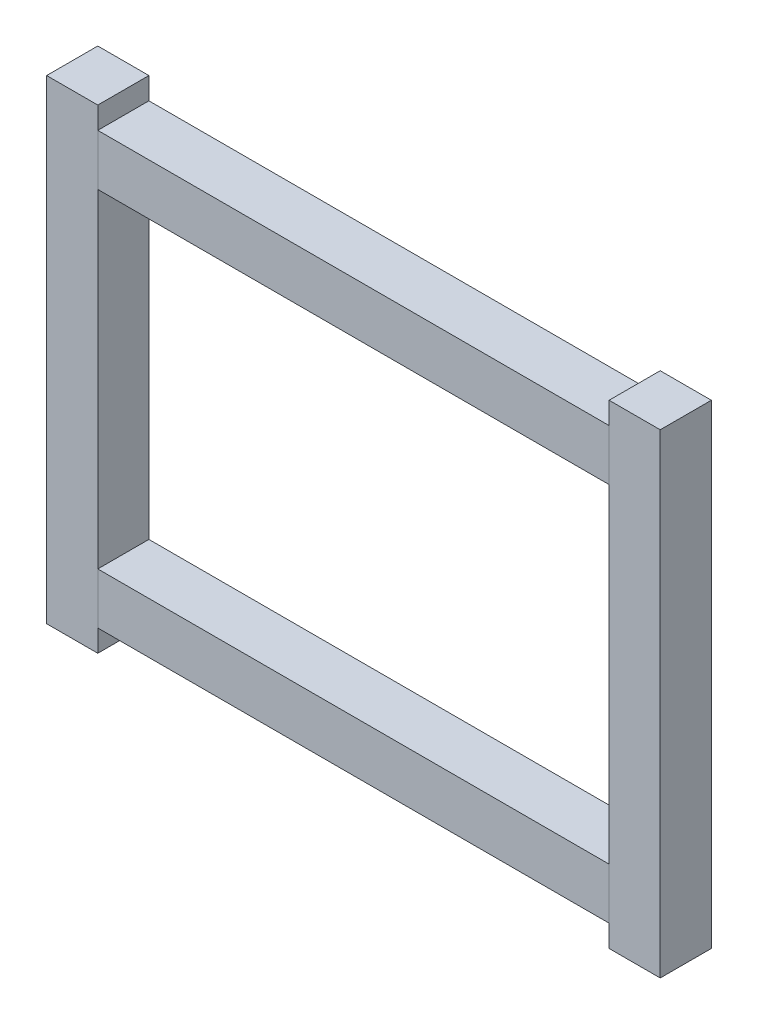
ISO-10303-21;
HEADER;
FILE_DESCRIPTION(('STEP AP214'),'2;1');
FILE_NAME('part.step','',(''),(''),'','','');
FILE_SCHEMA(('AUTOMOTIVE_DESIGN { 1 0 10303 214 1 1 1 1 }'));
ENDSEC;
DATA;
#1=APPLICATION_CONTEXT('core data for automotive mechanical design processes');
#2=APPLICATION_PROTOCOL_DEFINITION('international standard','automotive_design',2000,#1);
#3=PRODUCT_CONTEXT('',#1,'mechanical');
#4=PRODUCT('Part','Part','',(#3));
#5=PRODUCT_RELATED_PRODUCT_CATEGORY('part','',(#4));
#6=PRODUCT_DEFINITION_FORMATION('','',#4);
#7=PRODUCT_DEFINITION_CONTEXT('part definition',#1,'design');
#8=PRODUCT_DEFINITION('design','',#6,#7);
#9=PRODUCT_DEFINITION_SHAPE('','',#8);
#10=(LENGTH_UNIT() NAMED_UNIT(*) SI_UNIT(.MILLI.,.METRE.));
#11=(NAMED_UNIT(*) PLANE_ANGLE_UNIT() SI_UNIT($,.RADIAN.));
#12=(NAMED_UNIT(*) SI_UNIT($,.STERADIAN.) SOLID_ANGLE_UNIT());
#13=UNCERTAINTY_MEASURE_WITH_UNIT(LENGTH_MEASURE(1.E-05),#10,'distance_accuracy_value','');
#14=(GEOMETRIC_REPRESENTATION_CONTEXT(3) GLOBAL_UNCERTAINTY_ASSIGNED_CONTEXT((#13)) GLOBAL_UNIT_ASSIGNED_CONTEXT((#10,
#11,#12)) REPRESENTATION_CONTEXT('',''));
#15=CARTESIAN_POINT('',(0.,0.,0.));
#16=DIRECTION('',(0.,0.,1.));
#17=DIRECTION('',(1.,0.,0.));
#18=AXIS2_PLACEMENT_3D('',#15,#16,#17);
#19=CARTESIAN_POINT('',(140.,143.798989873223,0.));
#20=DIRECTION('',(-1.,0.,0.));
#21=DIRECTION('',(0.,-1.,0.));
#22=AXIS2_PLACEMENT_3D('',#19,#20,#21);
#23=PLANE('',#22);
#24=DIRECTION('',(0.,-1.,0.));
#25=VECTOR('',#24,1.);
#26=CARTESIAN_POINT('',(139.999999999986,103.999999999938,0.));
#27=LINE('',#26,#25);
#28=CARTESIAN_POINT('',(140.0000000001,118.,0.));
#29=VERTEX_POINT('',#28);
#30=CARTESIAN_POINT('',(140.0000000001,104.,0.));
#31=VERTEX_POINT('',#30);
#32=EDGE_CURVE('E110',#29,#31,#27,.T.);
#33=ORIENTED_EDGE('',*,*,#32,.F.);
#34=DIRECTION('',(0.,0.,-1.));
#35=VECTOR('',#34,1.);
#36=CARTESIAN_POINT('',(139.999999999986,118.,14.));
#37=LINE('',#36,#35);
#38=CARTESIAN_POINT('',(140.0000000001,118.,14.));
#39=VERTEX_POINT('',#38);
#40=EDGE_CURVE('E85',#39,#29,#37,.T.);
#41=ORIENTED_EDGE('',*,*,#40,.F.);
#42=DIRECTION('',(0.,1.,0.));
#43=VECTOR('',#42,1.);
#44=CARTESIAN_POINT('',(139.999999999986,103.999999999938,14.));
#45=LINE('',#44,#43);
#46=CARTESIAN_POINT('',(140.0000000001,104.,14.));
#47=VERTEX_POINT('',#46);
#48=EDGE_CURVE('E12',#47,#39,#45,.T.);
#49=ORIENTED_EDGE('',*,*,#48,.F.);
#50=DIRECTION('',(0.,0.,1.));
#51=VECTOR('',#50,1.);
#52=CARTESIAN_POINT('',(139.999999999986,104.,14.));
#53=LINE('',#52,#51);
#54=EDGE_CURVE('E45',#31,#47,#53,.T.);
#55=ORIENTED_EDGE('',*,*,#54,.F.);
#56=EDGE_LOOP('',(#33,#41,#49,#55));
#57=FACE_BOUND('',#56,.T.);
#58=ADVANCED_FACE('F42',(#57),#23,.F.);
#59=CARTESIAN_POINT('',(500000.,104.,14.));
#60=DIRECTION('',(0.,1.,0.));
#61=DIRECTION('',(0.,0.,1.));
#62=AXIS2_PLACEMENT_3D('',#59,#60,#61);
#63=PLANE('',#62);
#64=DIRECTION('',(-1.,0.,0.));
#65=VECTOR('',#64,1.);
#66=CARTESIAN_POINT('',(500000.,104.,0.));
#67=LINE('',#66,#65);
#68=CARTESIAN_POINT('',(0.,104.,0.));
#69=VERTEX_POINT('',#68);
#70=EDGE_CURVE('E86',#31,#69,#67,.T.);
#71=ORIENTED_EDGE('',*,*,#70,.F.);
#72=ORIENTED_EDGE('',*,*,#54,.T.);
#73=DIRECTION('',(-1.,0.,0.));
#74=VECTOR('',#73,1.);
#75=CARTESIAN_POINT('',(500000.,104.,14.));
#76=LINE('',#75,#74);
#77=CARTESIAN_POINT('',(0.,104.,14.));
#78=VERTEX_POINT('',#77);
#79=EDGE_CURVE('E78',#47,#78,#76,.T.);
#80=ORIENTED_EDGE('',*,*,#79,.T.);
#81=DIRECTION('',(0.,0.,-1.));
#82=VECTOR('',#81,1.);
#83=CARTESIAN_POINT('',(0.,104.,14.));
#84=LINE('',#83,#82);
#85=EDGE_CURVE('E81',#78,#69,#84,.T.);
#86=ORIENTED_EDGE('',*,*,#85,.T.);
#87=EDGE_LOOP('',(#71,#72,#80,#86));
#88=FACE_BOUND('',#87,.T.);
#89=ADVANCED_FACE('F80',(#88),#63,.F.);
#90=CARTESIAN_POINT('',(0.,118.,14.));
#91=DIRECTION('',(-1.,0.,0.));
#92=DIRECTION('',(0.,0.,1.));
#93=AXIS2_PLACEMENT_3D('',#90,#91,#92);
#94=PLANE('',#93);
#95=DIRECTION('',(0.,-1.,0.));
#96=VECTOR('',#95,1.);
#97=CARTESIAN_POINT('',(0.,104.,14.));
#98=LINE('',#97,#96);
#99=CARTESIAN_POINT('',(0.,118.,14.));
#100=VERTEX_POINT('',#99);
#101=EDGE_CURVE('E92',#100,#78,#98,.T.);
#102=ORIENTED_EDGE('',*,*,#101,.F.);
#103=DIRECTION('',(0.,0.,1.));
#104=VECTOR('',#103,1.);
#105=CARTESIAN_POINT('',(0.,118.,14.));
#106=LINE('',#105,#104);
#107=CARTESIAN_POINT('',(0.,118.,0.));
#108=VERTEX_POINT('',#107);
#109=EDGE_CURVE('E100',#108,#100,#106,.T.);
#110=ORIENTED_EDGE('',*,*,#109,.F.);
#111=DIRECTION('',(0.,1.,0.));
#112=VECTOR('',#111,1.);
#113=CARTESIAN_POINT('',(0.,104.,0.));
#114=LINE('',#113,#112);
#115=EDGE_CURVE('E94',#69,#108,#114,.T.);
#116=ORIENTED_EDGE('',*,*,#115,.F.);
#117=ORIENTED_EDGE('',*,*,#85,.F.);
#118=EDGE_LOOP('',(#102,#110,#116,#117));
#119=FACE_BOUND('',#118,.T.);
#120=ADVANCED_FACE('F90',(#119),#94,.T.);
#121=CARTESIAN_POINT('',(500000.,104.,0.));
#122=DIRECTION('',(0.,0.,1.));
#123=DIRECTION('',(1.,0.,0.));
#124=AXIS2_PLACEMENT_3D('',#121,#122,#123);
#125=PLANE('',#124);
#126=DIRECTION('',(-1.,0.,0.));
#127=VECTOR('',#126,1.);
#128=CARTESIAN_POINT('',(500000.,118.,0.));
#129=LINE('',#128,#127);
#130=EDGE_CURVE('E106',#29,#108,#129,.T.);
#131=ORIENTED_EDGE('',*,*,#130,.F.);
#132=ORIENTED_EDGE('',*,*,#32,.T.);
#133=ORIENTED_EDGE('',*,*,#70,.T.);
#134=ORIENTED_EDGE('',*,*,#115,.T.);
#135=EDGE_LOOP('',(#131,#132,#133,#134));
#136=FACE_BOUND('',#135,.T.);
#137=ADVANCED_FACE('F113',(#136),#125,.F.);
#138=CARTESIAN_POINT('',(500000.,104.,14.));
#139=DIRECTION('',(0.,0.,-1.));
#140=DIRECTION('',(-1.,0.,0.));
#141=AXIS2_PLACEMENT_3D('',#138,#139,#140);
#142=PLANE('',#141);
#143=ORIENTED_EDGE('',*,*,#79,.F.);
#144=ORIENTED_EDGE('',*,*,#48,.T.);
#145=DIRECTION('',(-1.,0.,0.));
#146=VECTOR('',#145,1.);
#147=CARTESIAN_POINT('',(500000.,118.,14.));
#148=LINE('',#147,#146);
#149=EDGE_CURVE('E95',#39,#100,#148,.T.);
#150=ORIENTED_EDGE('',*,*,#149,.T.);
#151=ORIENTED_EDGE('',*,*,#101,.T.);
#152=EDGE_LOOP('',(#143,#144,#150,#151));
#153=FACE_BOUND('',#152,.T.);
#154=ADVANCED_FACE('F97',(#153),#142,.F.);
#155=CARTESIAN_POINT('',(500000.,118.,14.));
#156=DIRECTION('',(0.,-1.,0.));
#157=DIRECTION('',(0.,0.,-1.));
#158=AXIS2_PLACEMENT_3D('',#155,#156,#157);
#159=PLANE('',#158);
#160=ORIENTED_EDGE('',*,*,#149,.F.);
#161=ORIENTED_EDGE('',*,*,#40,.T.);
#162=ORIENTED_EDGE('',*,*,#130,.T.);
#163=ORIENTED_EDGE('',*,*,#109,.T.);
#164=EDGE_LOOP('',(#160,#161,#162,#163));
#165=FACE_BOUND('',#164,.T.);
#166=ADVANCED_FACE('F116',(#165),#159,.F.);
#167=CLOSED_SHELL('',(#58,#89,#120,#137,#154,#166));
#168=MANIFOLD_SOLID_BREP('B2',#167);
#169=CARTESIAN_POINT('',(140.,143.798989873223,0.));
#170=DIRECTION('',(-1.,0.,0.));
#171=DIRECTION('',(0.,-1.,0.));
#172=AXIS2_PLACEMENT_3D('',#169,#170,#171);
#173=PLANE('',#172);
#174=DIRECTION('',(0.,0.,1.));
#175=VECTOR('',#174,1.);
#176=CARTESIAN_POINT('',(140.,124.,0.));
#177=LINE('',#176,#175);
#178=CARTESIAN_POINT('',(140.,124.,0.));
#179=VERTEX_POINT('',#178);
#180=CARTESIAN_POINT('',(140.,124.,14.));
#181=VERTEX_POINT('',#180);
#182=EDGE_CURVE('E184',#179,#181,#177,.T.);
#183=ORIENTED_EDGE('',*,*,#182,.F.);
#184=DIRECTION('',(0.,-1.,0.));
#185=VECTOR('',#184,1.);
#186=CARTESIAN_POINT('',(140.,143.798989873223,0.));
#187=LINE('',#186,#185);
#188=CARTESIAN_POINT('',(140.,-5.99999999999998,0.));
#189=VERTEX_POINT('',#188);
#190=EDGE_CURVE('E210',#179,#189,#187,.T.);
#191=ORIENTED_EDGE('',*,*,#190,.T.);
#192=DIRECTION('',(0.,0.,-1.));
#193=VECTOR('',#192,1.);
#194=CARTESIAN_POINT('',(140.,-5.99999999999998,0.));
#195=LINE('',#194,#193);
#196=CARTESIAN_POINT('',(140.,-5.99999999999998,14.));
#197=VERTEX_POINT('',#196);
#198=EDGE_CURVE('E214',#197,#189,#195,.T.);
#199=ORIENTED_EDGE('',*,*,#198,.F.);
#200=DIRECTION('',(0.,-1.,0.));
#201=VECTOR('',#200,1.);
#202=CARTESIAN_POINT('',(140.,143.798989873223,14.));
#203=LINE('',#202,#201);
#204=EDGE_CURVE('E236',#181,#197,#203,.T.);
#205=ORIENTED_EDGE('',*,*,#204,.F.);
#206=EDGE_LOOP('',(#183,#191,#199,#205));
#207=FACE_BOUND('',#206,.T.);
#208=ADVANCED_FACE('F176',(#207),#173,.T.);
#209=CARTESIAN_POINT('',(140.,143.798989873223,14.));
#210=DIRECTION('',(0.,0.,1.));
#211=DIRECTION('',(1.,0.,0.));
#212=AXIS2_PLACEMENT_3D('',#209,#210,#211);
#213=PLANE('',#212);
#214=DIRECTION('',(1.,0.,0.));
#215=VECTOR('',#214,1.);
#216=CARTESIAN_POINT('',(140.,124.,14.));
#217=LINE('',#216,#215);
#218=CARTESIAN_POINT('',(154.,124.,14.));
#219=VERTEX_POINT('',#218);
#220=EDGE_CURVE('E248',#181,#219,#217,.T.);
#221=ORIENTED_EDGE('',*,*,#220,.F.);
#222=ORIENTED_EDGE('',*,*,#204,.T.);
#223=DIRECTION('',(-1.,0.,0.));
#224=VECTOR('',#223,1.);
#225=CARTESIAN_POINT('',(140.,-5.99999999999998,14.));
#226=LINE('',#225,#224);
#227=CARTESIAN_POINT('',(154.,-5.99999999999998,14.));
#228=VERTEX_POINT('',#227);
#229=EDGE_CURVE('E218',#228,#197,#226,.T.);
#230=ORIENTED_EDGE('',*,*,#229,.F.);
#231=DIRECTION('',(0.,-1.,0.));
#232=VECTOR('',#231,1.);
#233=CARTESIAN_POINT('',(154.,143.798989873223,14.));
#234=LINE('',#233,#232);
#235=EDGE_CURVE('E239',#219,#228,#234,.T.);
#236=ORIENTED_EDGE('',*,*,#235,.F.);
#237=EDGE_LOOP('',(#221,#222,#230,#236));
#238=FACE_BOUND('',#237,.T.);
#239=ADVANCED_FACE('F247',(#238),#213,.T.);
#240=CARTESIAN_POINT('',(154.,143.798989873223,0.));
#241=DIRECTION('',(1.,0.,0.));
#242=DIRECTION('',(0.,1.,0.));
#243=AXIS2_PLACEMENT_3D('',#240,#241,#242);
#244=PLANE('',#243);
#245=DIRECTION('',(0.,0.,-1.));
#246=VECTOR('',#245,1.);
#247=CARTESIAN_POINT('',(154.,124.,0.));
#248=LINE('',#247,#246);
#249=CARTESIAN_POINT('',(154.,124.,0.));
#250=VERTEX_POINT('',#249);
#251=EDGE_CURVE('E238',#219,#250,#248,.T.);
#252=ORIENTED_EDGE('',*,*,#251,.F.);
#253=ORIENTED_EDGE('',*,*,#235,.T.);
#254=DIRECTION('',(0.,0.,1.));
#255=VECTOR('',#254,1.);
#256=CARTESIAN_POINT('',(154.,-5.99999999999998,0.));
#257=LINE('',#256,#255);
#258=CARTESIAN_POINT('',(154.,-5.99999999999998,0.));
#259=VERTEX_POINT('',#258);
#260=EDGE_CURVE('E226',#259,#228,#257,.T.);
#261=ORIENTED_EDGE('',*,*,#260,.F.);
#262=DIRECTION('',(0.,-1.,0.));
#263=VECTOR('',#262,1.);
#264=CARTESIAN_POINT('',(154.,143.798989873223,0.));
#265=LINE('',#264,#263);
#266=EDGE_CURVE('E217',#250,#259,#265,.T.);
#267=ORIENTED_EDGE('',*,*,#266,.F.);
#268=EDGE_LOOP('',(#252,#253,#261,#267));
#269=FACE_BOUND('',#268,.T.);
#270=ADVANCED_FACE('F244',(#269),#244,.T.);
#271=CARTESIAN_POINT('',(140.,143.798989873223,0.));
#272=DIRECTION('',(0.,0.,-1.));
#273=DIRECTION('',(-1.,0.,0.));
#274=AXIS2_PLACEMENT_3D('',#271,#272,#273);
#275=PLANE('',#274);
#276=DIRECTION('',(-1.,0.,0.));
#277=VECTOR('',#276,1.);
#278=CARTESIAN_POINT('',(140.,124.,0.));
#279=LINE('',#278,#277);
#280=EDGE_CURVE('E40',#250,#179,#279,.T.);
#281=ORIENTED_EDGE('',*,*,#280,.F.);
#282=ORIENTED_EDGE('',*,*,#266,.T.);
#283=DIRECTION('',(1.,0.,0.));
#284=VECTOR('',#283,1.);
#285=CARTESIAN_POINT('',(140.,-5.99999999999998,0.));
#286=LINE('',#285,#284);
#287=EDGE_CURVE('E220',#189,#259,#286,.T.);
#288=ORIENTED_EDGE('',*,*,#287,.F.);
#289=ORIENTED_EDGE('',*,*,#190,.F.);
#290=EDGE_LOOP('',(#281,#282,#288,#289));
#291=FACE_BOUND('',#290,.T.);
#292=ADVANCED_FACE('F221',(#291),#275,.T.);
#293=CARTESIAN_POINT('',(140.,-5.99999999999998,14.));
#294=DIRECTION('',(0.,1.,0.));
#295=DIRECTION('',(-1.,0.,0.));
#296=AXIS2_PLACEMENT_3D('',#293,#294,#295);
#297=PLANE('',#296);
#298=ORIENTED_EDGE('',*,*,#198,.T.);
#299=ORIENTED_EDGE('',*,*,#287,.T.);
#300=ORIENTED_EDGE('',*,*,#260,.T.);
#301=ORIENTED_EDGE('',*,*,#229,.T.);
#302=EDGE_LOOP('',(#298,#299,#300,#301));
#303=FACE_BOUND('',#302,.T.);
#304=ADVANCED_FACE('F228',(#303),#297,.F.);
#305=CARTESIAN_POINT('',(0.,124.,14.));
#306=DIRECTION('',(0.,-1.,0.));
#307=DIRECTION('',(0.,0.,-1.));
#308=AXIS2_PLACEMENT_3D('',#305,#306,#307);
#309=PLANE('',#308);
#310=ORIENTED_EDGE('',*,*,#182,.T.);
#311=ORIENTED_EDGE('',*,*,#220,.T.);
#312=ORIENTED_EDGE('',*,*,#251,.T.);
#313=ORIENTED_EDGE('',*,*,#280,.T.);
#314=EDGE_LOOP('',(#310,#311,#312,#313));
#315=FACE_BOUND('',#314,.T.);
#316=ADVANCED_FACE('F249',(#315),#309,.F.);
#317=CLOSED_SHELL('',(#208,#239,#270,#292,#304,#316));
#318=MANIFOLD_SOLID_BREP('B6',#317);
#319=CARTESIAN_POINT('',(0.,0.,14.));
#320=DIRECTION('',(1.,0.,0.));
#321=DIRECTION('',(0.,0.,-1.));
#322=AXIS2_PLACEMENT_3D('',#319,#320,#321);
#323=PLANE('',#322);
#324=DIRECTION('',(0.,-1.,0.));
#325=VECTOR('',#324,1.);
#326=CARTESIAN_POINT('',(0.,0.,0.));
#327=LINE('',#326,#325);
#328=CARTESIAN_POINT('',(0.,14.,0.));
#329=VERTEX_POINT('',#328);
#330=CARTESIAN_POINT('',(0.,0.,0.));
#331=VERTEX_POINT('',#330);
#332=EDGE_CURVE('E372',#329,#331,#327,.T.);
#333=ORIENTED_EDGE('',*,*,#332,.T.);
#334=DIRECTION('',(0.,0.,-1.));
#335=VECTOR('',#334,1.);
#336=CARTESIAN_POINT('',(0.,0.,14.));
#337=LINE('',#336,#335);
#338=CARTESIAN_POINT('',(0.,0.,14.));
#339=VERTEX_POINT('',#338);
#340=EDGE_CURVE('E174',#339,#331,#337,.T.);
#341=ORIENTED_EDGE('',*,*,#340,.F.);
#342=DIRECTION('',(0.,-1.,0.));
#343=VECTOR('',#342,1.);
#344=CARTESIAN_POINT('',(0.,0.,14.));
#345=LINE('',#344,#343);
#346=CARTESIAN_POINT('',(0.,14.,14.));
#347=VERTEX_POINT('',#346);
#348=EDGE_CURVE('E360',#347,#339,#345,.T.);
#349=ORIENTED_EDGE('',*,*,#348,.F.);
#350=DIRECTION('',(0.,0.,-1.));
#351=VECTOR('',#350,1.);
#352=CARTESIAN_POINT('',(0.,14.,14.));
#353=LINE('',#352,#351);
#354=EDGE_CURVE('E368',#347,#329,#353,.T.);
#355=ORIENTED_EDGE('',*,*,#354,.T.);
#356=EDGE_LOOP('',(#333,#341,#349,#355));
#357=FACE_BOUND('',#356,.T.);
#358=ADVANCED_FACE('F309',(#357),#323,.F.);
#359=CARTESIAN_POINT('',(0.,0.,14.));
#360=DIRECTION('',(0.,1.,0.));
#361=DIRECTION('',(0.,0.,1.));
#362=AXIS2_PLACEMENT_3D('',#359,#360,#361);
#363=PLANE('',#362);
#364=DIRECTION('',(1.,0.,0.));
#365=VECTOR('',#364,1.);
#366=CARTESIAN_POINT('',(0.,0.,0.));
#367=LINE('',#366,#365);
#368=CARTESIAN_POINT('',(140.,0.,0.));
#369=VERTEX_POINT('',#368);
#370=EDGE_CURVE('E364',#331,#369,#367,.T.);
#371=ORIENTED_EDGE('',*,*,#370,.T.);
#372=DIRECTION('',(0.,0.,-1.));
#373=VECTOR('',#372,1.);
#374=CARTESIAN_POINT('',(140.,0.,14.));
#375=LINE('',#374,#373);
#376=CARTESIAN_POINT('',(140.,0.,14.));
#377=VERTEX_POINT('',#376);
#378=EDGE_CURVE('E317',#377,#369,#375,.T.);
#379=ORIENTED_EDGE('',*,*,#378,.F.);
#380=DIRECTION('',(1.,0.,0.));
#381=VECTOR('',#380,1.);
#382=CARTESIAN_POINT('',(0.,0.,14.));
#383=LINE('',#382,#381);
#384=EDGE_CURVE('E355',#339,#377,#383,.T.);
#385=ORIENTED_EDGE('',*,*,#384,.F.);
#386=ORIENTED_EDGE('',*,*,#340,.T.);
#387=EDGE_LOOP('',(#371,#379,#385,#386));
#388=FACE_BOUND('',#387,.T.);
#389=ADVANCED_FACE('F363',(#388),#363,.F.);
#390=CARTESIAN_POINT('',(140.,0.,14.));
#391=DIRECTION('',(-1.,0.,0.));
#392=DIRECTION('',(0.,0.,1.));
#393=AXIS2_PLACEMENT_3D('',#390,#391,#392);
#394=PLANE('',#393);
#395=DIRECTION('',(0.,1.,0.));
#396=VECTOR('',#395,1.);
#397=CARTESIAN_POINT('',(140.,0.,0.));
#398=LINE('',#397,#396);
#399=CARTESIAN_POINT('',(140.,14.,0.));
#400=VERTEX_POINT('',#399);
#401=EDGE_CURVE('E342',#369,#400,#398,.T.);
#402=ORIENTED_EDGE('',*,*,#401,.T.);
#403=DIRECTION('',(0.,0.,-1.));
#404=VECTOR('',#403,1.);
#405=CARTESIAN_POINT('',(140.,14.,14.));
#406=LINE('',#405,#404);
#407=CARTESIAN_POINT('',(140.,14.,14.));
#408=VERTEX_POINT('',#407);
#409=EDGE_CURVE('E365',#408,#400,#406,.T.);
#410=ORIENTED_EDGE('',*,*,#409,.F.);
#411=DIRECTION('',(0.,1.,0.));
#412=VECTOR('',#411,1.);
#413=CARTESIAN_POINT('',(140.,0.,14.));
#414=LINE('',#413,#412);
#415=EDGE_CURVE('E358',#377,#408,#414,.T.);
#416=ORIENTED_EDGE('',*,*,#415,.F.);
#417=ORIENTED_EDGE('',*,*,#378,.T.);
#418=EDGE_LOOP('',(#402,#410,#416,#417));
#419=FACE_BOUND('',#418,.T.);
#420=ADVANCED_FACE('F366',(#419),#394,.F.);
#421=CARTESIAN_POINT('',(0.,14.,14.));
#422=DIRECTION('',(0.,-1.,0.));
#423=DIRECTION('',(0.,0.,-1.));
#424=AXIS2_PLACEMENT_3D('',#421,#422,#423);
#425=PLANE('',#424);
#426=DIRECTION('',(-1.,0.,0.));
#427=VECTOR('',#426,1.);
#428=CARTESIAN_POINT('',(0.,14.,0.));
#429=LINE('',#428,#427);
#430=EDGE_CURVE('E348',#400,#329,#429,.T.);
#431=ORIENTED_EDGE('',*,*,#430,.T.);
#432=ORIENTED_EDGE('',*,*,#354,.F.);
#433=DIRECTION('',(-1.,0.,0.));
#434=VECTOR('',#433,1.);
#435=CARTESIAN_POINT('',(0.,14.,14.));
#436=LINE('',#435,#434);
#437=EDGE_CURVE('E325',#408,#347,#436,.T.);
#438=ORIENTED_EDGE('',*,*,#437,.F.);
#439=ORIENTED_EDGE('',*,*,#409,.T.);
#440=EDGE_LOOP('',(#431,#432,#438,#439));
#441=FACE_BOUND('',#440,.T.);
#442=ADVANCED_FACE('F379',(#441),#425,.F.);
#443=CARTESIAN_POINT('',(0.,14.,14.));
#444=DIRECTION('',(0.,0.,-1.));
#445=DIRECTION('',(-1.,0.,0.));
#446=AXIS2_PLACEMENT_3D('',#443,#444,#445);
#447=PLANE('',#446);
#448=ORIENTED_EDGE('',*,*,#348,.T.);
#449=ORIENTED_EDGE('',*,*,#384,.T.);
#450=ORIENTED_EDGE('',*,*,#415,.T.);
#451=ORIENTED_EDGE('',*,*,#437,.T.);
#452=EDGE_LOOP('',(#448,#449,#450,#451));
#453=FACE_BOUND('',#452,.T.);
#454=ADVANCED_FACE('F356',(#453),#447,.F.);
#455=CARTESIAN_POINT('',(0.,14.,0.));
#456=DIRECTION('',(0.,0.,-1.));
#457=DIRECTION('',(-1.,0.,0.));
#458=AXIS2_PLACEMENT_3D('',#455,#456,#457);
#459=PLANE('',#458);
#460=ORIENTED_EDGE('',*,*,#332,.F.);
#461=ORIENTED_EDGE('',*,*,#430,.F.);
#462=ORIENTED_EDGE('',*,*,#401,.F.);
#463=ORIENTED_EDGE('',*,*,#370,.F.);
#464=EDGE_LOOP('',(#460,#461,#462,#463));
#465=FACE_BOUND('',#464,.T.);
#466=ADVANCED_FACE('F382',(#465),#459,.T.);
#467=CLOSED_SHELL('',(#358,#389,#420,#442,#454,#466));
#468=MANIFOLD_SOLID_BREP('B34',#467);
#469=CARTESIAN_POINT('',(0.,-6.,14.));
#470=DIRECTION('',(-1.,0.,0.));
#471=DIRECTION('',(0.,0.,1.));
#472=AXIS2_PLACEMENT_3D('',#469,#470,#471);
#473=PLANE('',#472);
#474=DIRECTION('',(0.,1.,0.));
#475=VECTOR('',#474,1.);
#476=CARTESIAN_POINT('',(0.,-6.,0.));
#477=LINE('',#476,#475);
#478=CARTESIAN_POINT('',(0.,-6.,0.));
#479=VERTEX_POINT('',#478);
#480=CARTESIAN_POINT('',(0.,124.,0.));
#481=VERTEX_POINT('',#480);
#482=EDGE_CURVE('E496',#479,#481,#477,.T.);
#483=ORIENTED_EDGE('',*,*,#482,.T.);
#484=DIRECTION('',(0.,0.,-1.));
#485=VECTOR('',#484,1.);
#486=CARTESIAN_POINT('',(0.,124.,14.));
#487=LINE('',#486,#485);
#488=CARTESIAN_POINT('',(0.,124.,14.));
#489=VERTEX_POINT('',#488);
#490=EDGE_CURVE('E307',#489,#481,#487,.T.);
#491=ORIENTED_EDGE('',*,*,#490,.F.);
#492=DIRECTION('',(0.,1.,0.));
#493=VECTOR('',#492,1.);
#494=CARTESIAN_POINT('',(0.,-6.,14.));
#495=LINE('',#494,#493);
#496=CARTESIAN_POINT('',(0.,-6.,14.));
#497=VERTEX_POINT('',#496);
#498=EDGE_CURVE('E484',#497,#489,#495,.T.);
#499=ORIENTED_EDGE('',*,*,#498,.F.);
#500=DIRECTION('',(0.,0.,-1.));
#501=VECTOR('',#500,1.);
#502=CARTESIAN_POINT('',(0.,-6.,14.));
#503=LINE('',#502,#501);
#504=EDGE_CURVE('E492',#497,#479,#503,.T.);
#505=ORIENTED_EDGE('',*,*,#504,.T.);
#506=EDGE_LOOP('',(#483,#491,#499,#505));
#507=FACE_BOUND('',#506,.T.);
#508=ADVANCED_FACE('F433',(#507),#473,.F.);
#509=CARTESIAN_POINT('',(0.,124.,14.));
#510=DIRECTION('',(0.,-1.,0.));
#511=DIRECTION('',(0.,0.,-1.));
#512=AXIS2_PLACEMENT_3D('',#509,#510,#511);
#513=PLANE('',#512);
#514=DIRECTION('',(-1.,0.,0.));
#515=VECTOR('',#514,1.);
#516=CARTESIAN_POINT('',(0.,124.,0.));
#517=LINE('',#516,#515);
#518=CARTESIAN_POINT('',(-14.,124.,0.));
#519=VERTEX_POINT('',#518);
#520=EDGE_CURVE('E488',#481,#519,#517,.T.);
#521=ORIENTED_EDGE('',*,*,#520,.T.);
#522=DIRECTION('',(0.,0.,-1.));
#523=VECTOR('',#522,1.);
#524=CARTESIAN_POINT('',(-14.,124.,14.));
#525=LINE('',#524,#523);
#526=CARTESIAN_POINT('',(-14.,124.,14.));
#527=VERTEX_POINT('',#526);
#528=EDGE_CURVE('E441',#527,#519,#525,.T.);
#529=ORIENTED_EDGE('',*,*,#528,.F.);
#530=DIRECTION('',(-1.,0.,0.));
#531=VECTOR('',#530,1.);
#532=CARTESIAN_POINT('',(0.,124.,14.));
#533=LINE('',#532,#531);
#534=EDGE_CURVE('E479',#489,#527,#533,.T.);
#535=ORIENTED_EDGE('',*,*,#534,.F.);
#536=ORIENTED_EDGE('',*,*,#490,.T.);
#537=EDGE_LOOP('',(#521,#529,#535,#536));
#538=FACE_BOUND('',#537,.T.);
#539=ADVANCED_FACE('F487',(#538),#513,.F.);
#540=CARTESIAN_POINT('',(-14.,-6.,14.));
#541=DIRECTION('',(1.,0.,0.));
#542=DIRECTION('',(0.,0.,-1.));
#543=AXIS2_PLACEMENT_3D('',#540,#541,#542);
#544=PLANE('',#543);
#545=DIRECTION('',(0.,-1.,0.));
#546=VECTOR('',#545,1.);
#547=CARTESIAN_POINT('',(-14.,-6.,0.));
#548=LINE('',#547,#546);
#549=CARTESIAN_POINT('',(-14.,-6.,0.));
#550=VERTEX_POINT('',#549);
#551=EDGE_CURVE('E466',#519,#550,#548,.T.);
#552=ORIENTED_EDGE('',*,*,#551,.T.);
#553=DIRECTION('',(0.,0.,-1.));
#554=VECTOR('',#553,1.);
#555=CARTESIAN_POINT('',(-14.,-6.,14.));
#556=LINE('',#555,#554);
#557=CARTESIAN_POINT('',(-14.,-6.,14.));
#558=VERTEX_POINT('',#557);
#559=EDGE_CURVE('E489',#558,#550,#556,.T.);
#560=ORIENTED_EDGE('',*,*,#559,.F.);
#561=DIRECTION('',(0.,-1.,0.));
#562=VECTOR('',#561,1.);
#563=CARTESIAN_POINT('',(-14.,-6.,14.));
#564=LINE('',#563,#562);
#565=EDGE_CURVE('E482',#527,#558,#564,.T.);
#566=ORIENTED_EDGE('',*,*,#565,.F.);
#567=ORIENTED_EDGE('',*,*,#528,.T.);
#568=EDGE_LOOP('',(#552,#560,#566,#567));
#569=FACE_BOUND('',#568,.T.);
#570=ADVANCED_FACE('F490',(#569),#544,.F.);
#571=CARTESIAN_POINT('',(0.,-6.,14.));
#572=DIRECTION('',(0.,1.,0.));
#573=DIRECTION('',(-1.,0.,0.));
#574=AXIS2_PLACEMENT_3D('',#571,#572,#573);
#575=PLANE('',#574);
#576=DIRECTION('',(1.,0.,0.));
#577=VECTOR('',#576,1.);
#578=CARTESIAN_POINT('',(0.,-6.,0.));
#579=LINE('',#578,#577);
#580=EDGE_CURVE('E472',#550,#479,#579,.T.);
#581=ORIENTED_EDGE('',*,*,#580,.T.);
#582=ORIENTED_EDGE('',*,*,#504,.F.);
#583=DIRECTION('',(1.,0.,0.));
#584=VECTOR('',#583,1.);
#585=CARTESIAN_POINT('',(0.,-6.,14.));
#586=LINE('',#585,#584);
#587=EDGE_CURVE('E449',#558,#497,#586,.T.);
#588=ORIENTED_EDGE('',*,*,#587,.F.);
#589=ORIENTED_EDGE('',*,*,#559,.T.);
#590=EDGE_LOOP('',(#581,#582,#588,#589));
#591=FACE_BOUND('',#590,.T.);
#592=ADVANCED_FACE('F503',(#591),#575,.F.);
#593=CARTESIAN_POINT('',(0.,124.,14.));
#594=DIRECTION('',(0.,0.,1.));
#595=DIRECTION('',(1.,0.,0.));
#596=AXIS2_PLACEMENT_3D('',#593,#594,#595);
#597=PLANE('',#596);
#598=ORIENTED_EDGE('',*,*,#498,.T.);
#599=ORIENTED_EDGE('',*,*,#534,.T.);
#600=ORIENTED_EDGE('',*,*,#565,.T.);
#601=ORIENTED_EDGE('',*,*,#587,.T.);
#602=EDGE_LOOP('',(#598,#599,#600,#601));
#603=FACE_BOUND('',#602,.T.);
#604=ADVANCED_FACE('F480',(#603),#597,.T.);
#605=CARTESIAN_POINT('',(0.,124.,0.));
#606=DIRECTION('',(0.,0.,1.));
#607=DIRECTION('',(1.,0.,0.));
#608=AXIS2_PLACEMENT_3D('',#605,#606,#607);
#609=PLANE('',#608);
#610=ORIENTED_EDGE('',*,*,#482,.F.);
#611=ORIENTED_EDGE('',*,*,#580,.F.);
#612=ORIENTED_EDGE('',*,*,#551,.F.);
#613=ORIENTED_EDGE('',*,*,#520,.F.);
#614=EDGE_LOOP('',(#610,#611,#612,#613));
#615=FACE_BOUND('',#614,.T.);
#616=ADVANCED_FACE('F506',(#615),#609,.F.);
#617=CLOSED_SHELL('',(#508,#539,#570,#592,#604,#616));
#618=MANIFOLD_SOLID_BREP('B168',#617);
#619=ADVANCED_BREP_SHAPE_REPRESENTATION('',(#18,#168,#318,#468,#618),#14);
#620=SHAPE_DEFINITION_REPRESENTATION(#9,#619);
ENDSEC;
END-ISO-10303-21;
